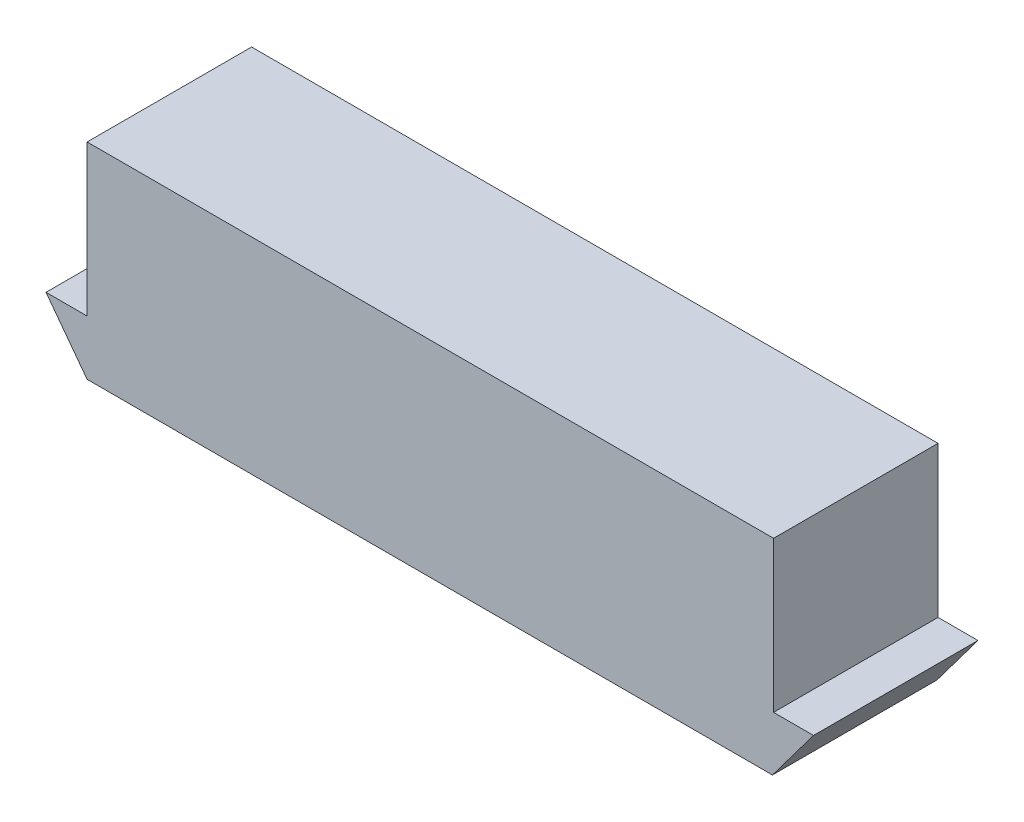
ISO-10303-21;
HEADER;
FILE_DESCRIPTION(('STEP AP214'),'2;1');
FILE_NAME('part.step','',(''),(''),'','','');
FILE_SCHEMA(('AUTOMOTIVE_DESIGN { 1 0 10303 214 1 1 1 1 }'));
ENDSEC;
DATA;
#1=APPLICATION_CONTEXT('core data for automotive mechanical design processes');
#2=APPLICATION_PROTOCOL_DEFINITION('international standard','automotive_design',2000,#1);
#3=PRODUCT_CONTEXT('',#1,'mechanical');
#4=PRODUCT('Part','Part','',(#3));
#5=PRODUCT_RELATED_PRODUCT_CATEGORY('part','',(#4));
#6=PRODUCT_DEFINITION_FORMATION('','',#4);
#7=PRODUCT_DEFINITION_CONTEXT('part definition',#1,'design');
#8=PRODUCT_DEFINITION('design','',#6,#7);
#9=PRODUCT_DEFINITION_SHAPE('','',#8);
#10=(LENGTH_UNIT() NAMED_UNIT(*) SI_UNIT(.MILLI.,.METRE.));
#11=(NAMED_UNIT(*) PLANE_ANGLE_UNIT() SI_UNIT($,.RADIAN.));
#12=(NAMED_UNIT(*) SI_UNIT($,.STERADIAN.) SOLID_ANGLE_UNIT());
#13=UNCERTAINTY_MEASURE_WITH_UNIT(LENGTH_MEASURE(1.E-05),#10,'distance_accuracy_value','');
#14=(GEOMETRIC_REPRESENTATION_CONTEXT(3) GLOBAL_UNCERTAINTY_ASSIGNED_CONTEXT((#13)) GLOBAL_UNIT_ASSIGNED_CONTEXT((#10,
#11,#12)) REPRESENTATION_CONTEXT('',''));
#15=CARTESIAN_POINT('',(0.,0.,0.));
#16=DIRECTION('',(0.,0.,1.));
#17=DIRECTION('',(1.,0.,0.));
#18=AXIS2_PLACEMENT_3D('',#15,#16,#17);
#19=CARTESIAN_POINT('',(28.,-7.5,12.));
#20=DIRECTION('',(0.,1.,0.));
#21=DIRECTION('',(0.,0.,1.));
#22=AXIS2_PLACEMENT_3D('',#19,#20,#21);
#23=PLANE('',#22);
#24=DIRECTION('',(1.,0.,0.));
#25=VECTOR('',#24,1.);
#26=CARTESIAN_POINT('',(28.,-7.5,0.));
#27=LINE('',#26,#25);
#28=CARTESIAN_POINT('',(-25.,-7.5,0.));
#29=VERTEX_POINT('',#28);
#30=CARTESIAN_POINT('',(25.,-7.5,0.));
#31=VERTEX_POINT('',#30);
#32=EDGE_CURVE('E163',#29,#31,#27,.T.);
#33=ORIENTED_EDGE('',*,*,#32,.T.);
#34=DIRECTION('',(0.,0.,1.));
#35=VECTOR('',#34,1.);
#36=CARTESIAN_POINT('',(25.,-7.5,0.));
#37=LINE('',#36,#35);
#38=CARTESIAN_POINT('',(25.,-7.5,12.));
#39=VERTEX_POINT('',#38);
#40=EDGE_CURVE('E47',#31,#39,#37,.T.);
#41=ORIENTED_EDGE('',*,*,#40,.T.);
#42=DIRECTION('',(1.,0.,0.));
#43=VECTOR('',#42,1.);
#44=CARTESIAN_POINT('',(28.,-7.5,12.));
#45=LINE('',#44,#43);
#46=CARTESIAN_POINT('',(-25.,-7.5,12.));
#47=VERTEX_POINT('',#46);
#48=EDGE_CURVE('E39',#47,#39,#45,.T.);
#49=ORIENTED_EDGE('',*,*,#48,.F.);
#50=DIRECTION('',(0.,0.,1.));
#51=VECTOR('',#50,1.);
#52=CARTESIAN_POINT('',(-25.,-7.5,0.));
#53=LINE('',#52,#51);
#54=EDGE_CURVE('E158',#29,#47,#53,.T.);
#55=ORIENTED_EDGE('',*,*,#54,.F.);
#56=EDGE_LOOP('',(#33,#41,#49,#55));
#57=FACE_BOUND('',#56,.T.);
#58=ADVANCED_FACE('F31',(#57),#23,.F.);
#59=CARTESIAN_POINT('',(28.,7.5,12.));
#60=DIRECTION('',(0.,-1.,0.));
#61=DIRECTION('',(0.,0.,-1.));
#62=AXIS2_PLACEMENT_3D('',#59,#60,#61);
#63=PLANE('',#62);
#64=DIRECTION('',(-1.,0.,0.));
#65=VECTOR('',#64,1.);
#66=CARTESIAN_POINT('',(28.,7.5,0.));
#67=LINE('',#66,#65);
#68=CARTESIAN_POINT('',(25.0844121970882,7.5,0.));
#69=VERTEX_POINT('',#68);
#70=CARTESIAN_POINT('',(-25.,7.5,0.));
#71=VERTEX_POINT('',#70);
#72=EDGE_CURVE('E34',#69,#71,#67,.T.);
#73=ORIENTED_EDGE('',*,*,#72,.T.);
#74=DIRECTION('',(0.,0.,-1.));
#75=VECTOR('',#74,1.);
#76=CARTESIAN_POINT('',(-25.,7.5,12.));
#77=LINE('',#76,#75);
#78=CARTESIAN_POINT('',(-25.,7.5,12.));
#79=VERTEX_POINT('',#78);
#80=EDGE_CURVE('E112',#79,#71,#77,.T.);
#81=ORIENTED_EDGE('',*,*,#80,.F.);
#82=DIRECTION('',(-1.,0.,0.));
#83=VECTOR('',#82,1.);
#84=CARTESIAN_POINT('',(28.,7.5,12.));
#85=LINE('',#84,#83);
#86=CARTESIAN_POINT('',(25.0844121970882,7.5,12.));
#87=VERTEX_POINT('',#86);
#88=EDGE_CURVE('E11',#87,#79,#85,.T.);
#89=ORIENTED_EDGE('',*,*,#88,.F.);
#90=DIRECTION('',(0.,0.,-1.));
#91=VECTOR('',#90,1.);
#92=CARTESIAN_POINT('',(25.0844121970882,7.5,12.));
#93=LINE('',#92,#91);
#94=EDGE_CURVE('E142',#87,#69,#93,.T.);
#95=ORIENTED_EDGE('',*,*,#94,.T.);
#96=EDGE_LOOP('',(#73,#81,#89,#95));
#97=FACE_BOUND('',#96,.T.);
#98=ADVANCED_FACE('F174',(#97),#63,.F.);
#99=CARTESIAN_POINT('',(-28.,7.5,12.));
#100=DIRECTION('',(0.,0.,1.));
#101=DIRECTION('',(1.,0.,0.));
#102=AXIS2_PLACEMENT_3D('',#99,#100,#101);
#103=PLANE('',#102);
#104=DIRECTION('',(-1.,0.,0.));
#105=VECTOR('',#104,1.);
#106=CARTESIAN_POINT('',(-25.,-3.5,12.));
#107=LINE('',#106,#105);
#108=CARTESIAN_POINT('',(-25.,-3.5,12.));
#109=VERTEX_POINT('',#108);
#110=CARTESIAN_POINT('',(-28.,-3.5,12.));
#111=VERTEX_POINT('',#110);
#112=EDGE_CURVE('E124',#109,#111,#107,.T.);
#113=ORIENTED_EDGE('',*,*,#112,.T.);
#114=DIRECTION('',(-0.6,0.8,0.));
#115=VECTOR('',#114,1.);
#116=CARTESIAN_POINT('',(-25.,-7.5,12.));
#117=LINE('',#116,#115);
#118=EDGE_CURVE('E152',#47,#111,#117,.T.);
#119=ORIENTED_EDGE('',*,*,#118,.F.);
#120=ORIENTED_EDGE('',*,*,#48,.T.);
#121=DIRECTION('',(-0.6,-0.8,0.));
#122=VECTOR('',#121,1.);
#123=CARTESIAN_POINT('',(25.,-7.5,12.));
#124=LINE('',#123,#122);
#125=CARTESIAN_POINT('',(28.,-3.5,12.));
#126=VERTEX_POINT('',#125);
#127=EDGE_CURVE('E145',#126,#39,#124,.T.);
#128=ORIENTED_EDGE('',*,*,#127,.F.);
#129=DIRECTION('',(-1.,0.,0.));
#130=VECTOR('',#129,1.);
#131=CARTESIAN_POINT('',(28.,-3.5,12.));
#132=LINE('',#131,#130);
#133=CARTESIAN_POINT('',(25.0844121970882,-3.5,12.));
#134=VERTEX_POINT('',#133);
#135=EDGE_CURVE('E131',#126,#134,#132,.T.);
#136=ORIENTED_EDGE('',*,*,#135,.T.);
#137=DIRECTION('',(0.,1.,0.));
#138=VECTOR('',#137,1.);
#139=CARTESIAN_POINT('',(25.0844121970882,-3.5,12.));
#140=LINE('',#139,#138);
#141=EDGE_CURVE('E134',#134,#87,#140,.T.);
#142=ORIENTED_EDGE('',*,*,#141,.T.);
#143=ORIENTED_EDGE('',*,*,#88,.T.);
#144=DIRECTION('',(0.,-1.,0.));
#145=VECTOR('',#144,1.);
#146=CARTESIAN_POINT('',(-25.,7.5,12.));
#147=LINE('',#146,#145);
#148=EDGE_CURVE('E119',#79,#109,#147,.T.);
#149=ORIENTED_EDGE('',*,*,#148,.T.);
#150=EDGE_LOOP('',(#113,#119,#120,#128,#136,#142,#143,#149));
#151=FACE_BOUND('',#150,.T.);
#152=ADVANCED_FACE('F184',(#151),#103,.T.);
#153=CARTESIAN_POINT('',(-28.,7.5,0.));
#154=DIRECTION('',(0.,0.,1.));
#155=DIRECTION('',(1.,0.,0.));
#156=AXIS2_PLACEMENT_3D('',#153,#154,#155);
#157=PLANE('',#156);
#158=DIRECTION('',(-0.6,0.8,0.));
#159=VECTOR('',#158,1.);
#160=CARTESIAN_POINT('',(-25.,-7.5,0.));
#161=LINE('',#160,#159);
#162=CARTESIAN_POINT('',(-28.,-3.5,0.));
#163=VERTEX_POINT('',#162);
#164=EDGE_CURVE('E155',#29,#163,#161,.T.);
#165=ORIENTED_EDGE('',*,*,#164,.T.);
#166=DIRECTION('',(-1.,0.,0.));
#167=VECTOR('',#166,1.);
#168=CARTESIAN_POINT('',(-25.,-3.5,0.));
#169=LINE('',#168,#167);
#170=CARTESIAN_POINT('',(-25.,-3.5,0.));
#171=VERTEX_POINT('',#170);
#172=EDGE_CURVE('E55',#171,#163,#169,.T.);
#173=ORIENTED_EDGE('',*,*,#172,.F.);
#174=DIRECTION('',(0.,-1.,0.));
#175=VECTOR('',#174,1.);
#176=CARTESIAN_POINT('',(-25.,7.5,0.));
#177=LINE('',#176,#175);
#178=EDGE_CURVE('E121',#71,#171,#177,.T.);
#179=ORIENTED_EDGE('',*,*,#178,.F.);
#180=ORIENTED_EDGE('',*,*,#72,.F.);
#181=DIRECTION('',(0.,1.,0.));
#182=VECTOR('',#181,1.);
#183=CARTESIAN_POINT('',(25.0844121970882,-3.5,0.));
#184=LINE('',#183,#182);
#185=CARTESIAN_POINT('',(25.0844121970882,-3.5,0.));
#186=VERTEX_POINT('',#185);
#187=EDGE_CURVE('E135',#186,#69,#184,.T.);
#188=ORIENTED_EDGE('',*,*,#187,.F.);
#189=DIRECTION('',(-1.,0.,0.));
#190=VECTOR('',#189,1.);
#191=CARTESIAN_POINT('',(28.,-3.5,0.));
#192=LINE('',#191,#190);
#193=CARTESIAN_POINT('',(28.,-3.5,0.));
#194=VERTEX_POINT('',#193);
#195=EDGE_CURVE('E126',#194,#186,#192,.T.);
#196=ORIENTED_EDGE('',*,*,#195,.F.);
#197=DIRECTION('',(-0.6,-0.8,0.));
#198=VECTOR('',#197,1.);
#199=CARTESIAN_POINT('',(25.,-7.5,0.));
#200=LINE('',#199,#198);
#201=EDGE_CURVE('E147',#194,#31,#200,.T.);
#202=ORIENTED_EDGE('',*,*,#201,.T.);
#203=ORIENTED_EDGE('',*,*,#32,.F.);
#204=EDGE_LOOP('',(#165,#173,#179,#180,#188,#196,#202,#203));
#205=FACE_BOUND('',#204,.T.);
#206=ADVANCED_FACE('F179',(#205),#157,.F.);
#207=CARTESIAN_POINT('',(-25.,-7.5,0.));
#208=DIRECTION('',(0.8,0.6,0.));
#209=DIRECTION('',(-0.6,0.8,0.));
#210=AXIS2_PLACEMENT_3D('',#207,#208,#209);
#211=PLANE('',#210);
#212=ORIENTED_EDGE('',*,*,#118,.T.);
#213=DIRECTION('',(0.,0.,1.));
#214=VECTOR('',#213,1.);
#215=CARTESIAN_POINT('',(-28.,-3.5,0.));
#216=LINE('',#215,#214);
#217=EDGE_CURVE('E161',#163,#111,#216,.T.);
#218=ORIENTED_EDGE('',*,*,#217,.F.);
#219=ORIENTED_EDGE('',*,*,#164,.F.);
#220=ORIENTED_EDGE('',*,*,#54,.T.);
#221=EDGE_LOOP('',(#212,#218,#219,#220));
#222=FACE_BOUND('',#221,.T.);
#223=ADVANCED_FACE('F195',(#222),#211,.F.);
#224=CARTESIAN_POINT('',(25.,-7.5,0.));
#225=DIRECTION('',(-0.8,0.6,0.));
#226=DIRECTION('',(-0.6,-0.8,0.));
#227=AXIS2_PLACEMENT_3D('',#224,#225,#226);
#228=PLANE('',#227);
#229=ORIENTED_EDGE('',*,*,#127,.T.);
#230=ORIENTED_EDGE('',*,*,#40,.F.);
#231=ORIENTED_EDGE('',*,*,#201,.F.);
#232=DIRECTION('',(0.,0.,1.));
#233=VECTOR('',#232,1.);
#234=CARTESIAN_POINT('',(28.,-3.5,0.));
#235=LINE('',#234,#233);
#236=EDGE_CURVE('E149',#194,#126,#235,.T.);
#237=ORIENTED_EDGE('',*,*,#236,.T.);
#238=EDGE_LOOP('',(#229,#230,#231,#237));
#239=FACE_BOUND('',#238,.T.);
#240=ADVANCED_FACE('F192',(#239),#228,.F.);
#241=CARTESIAN_POINT('',(25.0844121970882,-3.5,12.));
#242=DIRECTION('',(-1.,0.,0.));
#243=DIRECTION('',(0.,0.,1.));
#244=AXIS2_PLACEMENT_3D('',#241,#242,#243);
#245=PLANE('',#244);
#246=ORIENTED_EDGE('',*,*,#187,.T.);
#247=ORIENTED_EDGE('',*,*,#94,.F.);
#248=ORIENTED_EDGE('',*,*,#141,.F.);
#249=DIRECTION('',(0.,0.,-1.));
#250=VECTOR('',#249,1.);
#251=CARTESIAN_POINT('',(25.0844121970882,-3.5,12.));
#252=LINE('',#251,#250);
#253=EDGE_CURVE('E138',#134,#186,#252,.T.);
#254=ORIENTED_EDGE('',*,*,#253,.T.);
#255=EDGE_LOOP('',(#246,#247,#248,#254));
#256=FACE_BOUND('',#255,.T.);
#257=ADVANCED_FACE('F189',(#256),#245,.F.);
#258=CARTESIAN_POINT('',(28.,-3.5,12.));
#259=DIRECTION('',(0.,-1.,0.));
#260=DIRECTION('',(0.,0.,-1.));
#261=AXIS2_PLACEMENT_3D('',#258,#259,#260);
#262=PLANE('',#261);
#263=ORIENTED_EDGE('',*,*,#195,.T.);
#264=ORIENTED_EDGE('',*,*,#253,.F.);
#265=ORIENTED_EDGE('',*,*,#135,.F.);
#266=ORIENTED_EDGE('',*,*,#236,.F.);
#267=EDGE_LOOP('',(#263,#264,#265,#266));
#268=FACE_BOUND('',#267,.T.);
#269=ADVANCED_FACE('F191',(#268),#262,.F.);
#270=CARTESIAN_POINT('',(-25.,-3.5,12.));
#271=DIRECTION('',(0.,-1.,0.));
#272=DIRECTION('',(0.,0.,-1.));
#273=AXIS2_PLACEMENT_3D('',#270,#271,#272);
#274=PLANE('',#273);
#275=ORIENTED_EDGE('',*,*,#172,.T.);
#276=ORIENTED_EDGE('',*,*,#217,.T.);
#277=ORIENTED_EDGE('',*,*,#112,.F.);
#278=DIRECTION('',(0.,0.,-1.));
#279=VECTOR('',#278,1.);
#280=CARTESIAN_POINT('',(-25.,-3.5,12.));
#281=LINE('',#280,#279);
#282=EDGE_CURVE('E109',#109,#171,#281,.T.);
#283=ORIENTED_EDGE('',*,*,#282,.T.);
#284=EDGE_LOOP('',(#275,#276,#277,#283));
#285=FACE_BOUND('',#284,.T.);
#286=ADVANCED_FACE('F196',(#285),#274,.F.);
#287=CARTESIAN_POINT('',(-25.,7.5,12.));
#288=DIRECTION('',(1.,0.,0.));
#289=DIRECTION('',(0.,0.,-1.));
#290=AXIS2_PLACEMENT_3D('',#287,#288,#289);
#291=PLANE('',#290);
#292=CARTESIAN_POINT('',(-25.,0.7,6.));
#293=DIRECTION('',(-1.,0.,0.));
#294=DIRECTION('',(0.,0.,1.));
#295=AXIS2_PLACEMENT_3D('',#292,#293,#294);
#296=CIRCLE('',#295,1.5875);
#297=CARTESIAN_POINT('',(-25.,0.7,7.5875));
#298=VERTEX_POINT('',#297);
#299=EDGE_CURVE('E283',#298,#298,#296,.T.);
#300=ORIENTED_EDGE('',*,*,#299,.F.);
#301=EDGE_LOOP('',(#300));
#302=FACE_BOUND('',#301,.T.);
#303=ORIENTED_EDGE('',*,*,#178,.T.);
#304=ORIENTED_EDGE('',*,*,#282,.F.);
#305=ORIENTED_EDGE('',*,*,#148,.F.);
#306=ORIENTED_EDGE('',*,*,#80,.T.);
#307=EDGE_LOOP('',(#303,#304,#305,#306));
#308=FACE_BOUND('',#307,.T.);
#309=ADVANCED_FACE('F103',(#302,#308),#291,.F.);
#310=CARTESIAN_POINT('',(-5.00000000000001,0.7,6.));
#311=DIRECTION('',(-1.,0.,0.));
#312=DIRECTION('',(0.,0.,1.));
#313=AXIS2_PLACEMENT_3D('',#310,#311,#312);
#314=CONICAL_SURFACE('',#313,0.698499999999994,1.02974425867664);
#315=CARTESIAN_POINT('',(-4.58029885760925,0.699999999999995,6.));
#316=VERTEX_POINT('',#315);
#317=VERTEX_LOOP('',#316);
#318=FACE_BOUND('',#317,.T.);
#319=CARTESIAN_POINT('',(-5.00000000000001,0.7,6.));
#320=DIRECTION('',(-1.,0.,0.));
#321=DIRECTION('',(0.,0.,1.));
#322=AXIS2_PLACEMENT_3D('',#319,#320,#321);
#323=CIRCLE('',#322,0.698499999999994);
#324=CARTESIAN_POINT('',(-5.00000000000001,0.7,6.69849999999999));
#325=VERTEX_POINT('',#324);
#326=EDGE_CURVE('E107',#325,#325,#323,.T.);
#327=ORIENTED_EDGE('',*,*,#326,.T.);
#328=EDGE_LOOP('',(#327));
#329=FACE_BOUND('',#328,.T.);
#330=ADVANCED_FACE('F99',(#318,#329),#314,.F.);
#331=CARTESIAN_POINT('',(-25.,0.7,6.));
#332=DIRECTION('',(-1.,0.,0.));
#333=DIRECTION('',(0.,0.,1.));
#334=AXIS2_PLACEMENT_3D('',#331,#332,#333);
#335=CYLINDRICAL_SURFACE('',#334,0.698499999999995);
#336=ORIENTED_EDGE('',*,*,#326,.F.);
#337=EDGE_LOOP('',(#336));
#338=FACE_BOUND('',#337,.T.);
#339=CARTESIAN_POINT('',(-21.999999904,0.7,6.));
#340=DIRECTION('',(-1.,0.,0.));
#341=DIRECTION('',(0.,0.,1.));
#342=AXIS2_PLACEMENT_3D('',#339,#340,#341);
#343=CIRCLE('',#342,0.698499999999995);
#344=CARTESIAN_POINT('',(-21.999999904,0.7,6.6985));
#345=VERTEX_POINT('',#344);
#346=EDGE_CURVE('E110',#345,#345,#343,.T.);
#347=ORIENTED_EDGE('',*,*,#346,.T.);
#348=EDGE_LOOP('',(#347));
#349=FACE_BOUND('',#348,.T.);
#350=ADVANCED_FACE('F102',(#338,#349),#335,.F.);
#351=CARTESIAN_POINT('',(-21.999999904,1.3985,6.));
#352=DIRECTION('',(1.,0.,0.));
#353=DIRECTION('',(0.,0.,-1.));
#354=AXIS2_PLACEMENT_3D('',#351,#352,#353);
#355=PLANE('',#354);
#356=ORIENTED_EDGE('',*,*,#346,.F.);
#357=EDGE_LOOP('',(#356));
#358=FACE_BOUND('',#357,.T.);
#359=CARTESIAN_POINT('',(-21.999999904,0.7,6.));
#360=DIRECTION('',(-1.,0.,0.));
#361=DIRECTION('',(0.,0.,1.));
#362=AXIS2_PLACEMENT_3D('',#359,#360,#361);
#363=CIRCLE('',#362,1.5875);
#364=CARTESIAN_POINT('',(-21.999999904,0.7,7.5875));
#365=VERTEX_POINT('',#364);
#366=EDGE_CURVE('E115',#365,#365,#363,.T.);
#367=ORIENTED_EDGE('',*,*,#366,.T.);
#368=EDGE_LOOP('',(#367));
#369=FACE_BOUND('',#368,.T.);
#370=ADVANCED_FACE('F255',(#358,#369),#355,.F.);
#371=CARTESIAN_POINT('',(-25.,0.7,6.));
#372=DIRECTION('',(-1.,0.,0.));
#373=DIRECTION('',(0.,0.,1.));
#374=AXIS2_PLACEMENT_3D('',#371,#372,#373);
#375=CYLINDRICAL_SURFACE('',#374,1.5875);
#376=ORIENTED_EDGE('',*,*,#366,.F.);
#377=EDGE_LOOP('',(#376));
#378=FACE_BOUND('',#377,.T.);
#379=ORIENTED_EDGE('',*,*,#299,.T.);
#380=EDGE_LOOP('',(#379));
#381=FACE_BOUND('',#380,.T.);
#382=ADVANCED_FACE('F264',(#378,#381),#375,.F.);
#383=CLOSED_SHELL('',(#58,#98,#152,#206,#223,#240,#257,#269,#286,#309,#330,#350,#370,#382));
#384=MANIFOLD_SOLID_BREP('B2',#383);
#385=ADVANCED_BREP_SHAPE_REPRESENTATION('',(#18,#384),#14);
#386=SHAPE_DEFINITION_REPRESENTATION(#9,#385);
ENDSEC;
END-ISO-10303-21;
